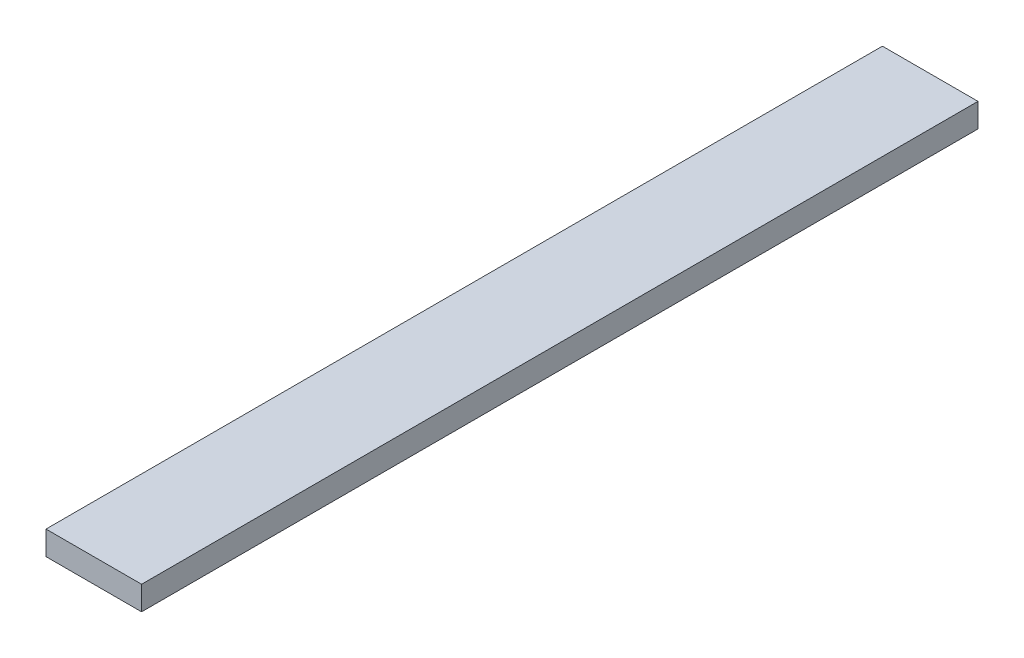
ISO-10303-21;
HEADER;
FILE_DESCRIPTION(('STEP AP214'),'2;1');
FILE_NAME('part.step','',(''),(''),'','','');
FILE_SCHEMA(('AUTOMOTIVE_DESIGN { 1 0 10303 214 1 1 1 1 }'));
ENDSEC;
DATA;
#1=APPLICATION_CONTEXT('core data for automotive mechanical design processes');
#2=APPLICATION_PROTOCOL_DEFINITION('international standard','automotive_design',2000,#1);
#3=PRODUCT_CONTEXT('',#1,'mechanical');
#4=PRODUCT('Part','Part','',(#3));
#5=PRODUCT_RELATED_PRODUCT_CATEGORY('part','',(#4));
#6=PRODUCT_DEFINITION_FORMATION('','',#4);
#7=PRODUCT_DEFINITION_CONTEXT('part definition',#1,'design');
#8=PRODUCT_DEFINITION('design','',#6,#7);
#9=PRODUCT_DEFINITION_SHAPE('','',#8);
#10=(LENGTH_UNIT() NAMED_UNIT(*) SI_UNIT(.MILLI.,.METRE.));
#11=(NAMED_UNIT(*) PLANE_ANGLE_UNIT() SI_UNIT($,.RADIAN.));
#12=(NAMED_UNIT(*) SI_UNIT($,.STERADIAN.) SOLID_ANGLE_UNIT());
#13=UNCERTAINTY_MEASURE_WITH_UNIT(LENGTH_MEASURE(1.E-05),#10,'distance_accuracy_value','');
#14=(GEOMETRIC_REPRESENTATION_CONTEXT(3) GLOBAL_UNCERTAINTY_ASSIGNED_CONTEXT((#13)) GLOBAL_UNIT_ASSIGNED_CONTEXT((#10,
#11,#12)) REPRESENTATION_CONTEXT('',''));
#15=CARTESIAN_POINT('',(0.,0.,0.));
#16=DIRECTION('',(0.,0.,1.));
#17=DIRECTION('',(1.,0.,0.));
#18=AXIS2_PLACEMENT_3D('',#15,#16,#17);
#19=CARTESIAN_POINT('',(25.4,-6.35,444.5));
#20=DIRECTION('',(-1.,0.,0.));
#21=DIRECTION('',(0.,0.,1.));
#22=AXIS2_PLACEMENT_3D('',#19,#20,#21);
#23=PLANE('',#22);
#24=DIRECTION('',(0.,1.,0.));
#25=VECTOR('',#24,1.);
#26=CARTESIAN_POINT('',(25.4,-6.35,0.));
#27=LINE('',#26,#25);
#28=CARTESIAN_POINT('',(25.4,-6.35,0.));
#29=VERTEX_POINT('',#28);
#30=CARTESIAN_POINT('',(25.4,6.35,0.));
#31=VERTEX_POINT('',#30);
#32=EDGE_CURVE('E113',#29,#31,#27,.T.);
#33=ORIENTED_EDGE('',*,*,#32,.T.);
#34=DIRECTION('',(0.,0.,-1.));
#35=VECTOR('',#34,1.);
#36=CARTESIAN_POINT('',(25.4,6.35,444.5));
#37=LINE('',#36,#35);
#38=CARTESIAN_POINT('',(25.4,6.35,444.5));
#39=VERTEX_POINT('',#38);
#40=EDGE_CURVE('E11',#39,#31,#37,.T.);
#41=ORIENTED_EDGE('',*,*,#40,.F.);
#42=DIRECTION('',(0.,1.,0.));
#43=VECTOR('',#42,1.);
#44=CARTESIAN_POINT('',(25.4,-6.35,444.5));
#45=LINE('',#44,#43);
#46=CARTESIAN_POINT('',(25.4,-6.35,444.5));
#47=VERTEX_POINT('',#46);
#48=EDGE_CURVE('E97',#47,#39,#45,.T.);
#49=ORIENTED_EDGE('',*,*,#48,.F.);
#50=DIRECTION('',(0.,0.,-1.));
#51=VECTOR('',#50,1.);
#52=CARTESIAN_POINT('',(25.4,-6.35,444.5));
#53=LINE('',#52,#51);
#54=EDGE_CURVE('E109',#47,#29,#53,.T.);
#55=ORIENTED_EDGE('',*,*,#54,.T.);
#56=EDGE_LOOP('',(#33,#41,#49,#55));
#57=FACE_BOUND('',#56,.T.);
#58=ADVANCED_FACE('F45',(#57),#23,.F.);
#59=CARTESIAN_POINT('',(-25.4,6.35,444.5));
#60=DIRECTION('',(0.,-1.,0.));
#61=DIRECTION('',(0.,0.,-1.));
#62=AXIS2_PLACEMENT_3D('',#59,#60,#61);
#63=PLANE('',#62);
#64=DIRECTION('',(-1.,0.,0.));
#65=VECTOR('',#64,1.);
#66=CARTESIAN_POINT('',(-25.4,6.35,0.));
#67=LINE('',#66,#65);
#68=CARTESIAN_POINT('',(-25.4,6.35,0.));
#69=VERTEX_POINT('',#68);
#70=EDGE_CURVE('E102',#31,#69,#67,.T.);
#71=ORIENTED_EDGE('',*,*,#70,.T.);
#72=DIRECTION('',(0.,0.,-1.));
#73=VECTOR('',#72,1.);
#74=CARTESIAN_POINT('',(-25.4,6.35,444.5));
#75=LINE('',#74,#73);
#76=CARTESIAN_POINT('',(-25.4,6.35,444.5));
#77=VERTEX_POINT('',#76);
#78=EDGE_CURVE('E54',#77,#69,#75,.T.);
#79=ORIENTED_EDGE('',*,*,#78,.F.);
#80=DIRECTION('',(-1.,0.,0.));
#81=VECTOR('',#80,1.);
#82=CARTESIAN_POINT('',(-25.4,6.35,444.5));
#83=LINE('',#82,#81);
#84=EDGE_CURVE('E92',#39,#77,#83,.T.);
#85=ORIENTED_EDGE('',*,*,#84,.F.);
#86=ORIENTED_EDGE('',*,*,#40,.T.);
#87=EDGE_LOOP('',(#71,#79,#85,#86));
#88=FACE_BOUND('',#87,.T.);
#89=ADVANCED_FACE('F101',(#88),#63,.F.);
#90=CARTESIAN_POINT('',(-25.4,-6.35,444.5));
#91=DIRECTION('',(1.,0.,0.));
#92=DIRECTION('',(0.,0.,-1.));
#93=AXIS2_PLACEMENT_3D('',#90,#91,#92);
#94=PLANE('',#93);
#95=DIRECTION('',(0.,-1.,0.));
#96=VECTOR('',#95,1.);
#97=CARTESIAN_POINT('',(-25.4,-6.35,0.));
#98=LINE('',#97,#96);
#99=CARTESIAN_POINT('',(-25.4,-6.35,0.));
#100=VERTEX_POINT('',#99);
#101=EDGE_CURVE('E79',#69,#100,#98,.T.);
#102=ORIENTED_EDGE('',*,*,#101,.T.);
#103=DIRECTION('',(0.,0.,-1.));
#104=VECTOR('',#103,1.);
#105=CARTESIAN_POINT('',(-25.4,-6.35,444.5));
#106=LINE('',#105,#104);
#107=CARTESIAN_POINT('',(-25.4,-6.35,444.5));
#108=VERTEX_POINT('',#107);
#109=EDGE_CURVE('E104',#108,#100,#106,.T.);
#110=ORIENTED_EDGE('',*,*,#109,.F.);
#111=DIRECTION('',(0.,-1.,0.));
#112=VECTOR('',#111,1.);
#113=CARTESIAN_POINT('',(-25.4,-6.35,444.5));
#114=LINE('',#113,#112);
#115=EDGE_CURVE('E95',#77,#108,#114,.T.);
#116=ORIENTED_EDGE('',*,*,#115,.F.);
#117=ORIENTED_EDGE('',*,*,#78,.T.);
#118=EDGE_LOOP('',(#102,#110,#116,#117));
#119=FACE_BOUND('',#118,.T.);
#120=ADVANCED_FACE('F105',(#119),#94,.F.);
#121=CARTESIAN_POINT('',(-25.4,-6.35,444.5));
#122=DIRECTION('',(0.,1.,0.));
#123=DIRECTION('',(0.,0.,1.));
#124=AXIS2_PLACEMENT_3D('',#121,#122,#123);
#125=PLANE('',#124);
#126=DIRECTION('',(1.,0.,0.));
#127=VECTOR('',#126,1.);
#128=CARTESIAN_POINT('',(-25.4,-6.35,0.));
#129=LINE('',#128,#127);
#130=EDGE_CURVE('E85',#100,#29,#129,.T.);
#131=ORIENTED_EDGE('',*,*,#130,.T.);
#132=ORIENTED_EDGE('',*,*,#54,.F.);
#133=DIRECTION('',(1.,0.,0.));
#134=VECTOR('',#133,1.);
#135=CARTESIAN_POINT('',(-25.4,-6.35,444.5));
#136=LINE('',#135,#134);
#137=EDGE_CURVE('E62',#108,#47,#136,.T.);
#138=ORIENTED_EDGE('',*,*,#137,.F.);
#139=ORIENTED_EDGE('',*,*,#109,.T.);
#140=EDGE_LOOP('',(#131,#132,#138,#139));
#141=FACE_BOUND('',#140,.T.);
#142=ADVANCED_FACE('F126',(#141),#125,.F.);
#143=CARTESIAN_POINT('',(0.,0.,444.5));
#144=DIRECTION('',(0.,0.,-1.));
#145=DIRECTION('',(-1.,0.,0.));
#146=AXIS2_PLACEMENT_3D('',#143,#144,#145);
#147=PLANE('',#146);
#148=ORIENTED_EDGE('',*,*,#48,.T.);
#149=ORIENTED_EDGE('',*,*,#84,.T.);
#150=ORIENTED_EDGE('',*,*,#115,.T.);
#151=ORIENTED_EDGE('',*,*,#137,.T.);
#152=EDGE_LOOP('',(#148,#149,#150,#151));
#153=FACE_BOUND('',#152,.T.);
#154=ADVANCED_FACE('F93',(#153),#147,.F.);
#155=CARTESIAN_POINT('',(0.,0.,0.));
#156=DIRECTION('',(0.,0.,-1.));
#157=DIRECTION('',(-1.,0.,0.));
#158=AXIS2_PLACEMENT_3D('',#155,#156,#157);
#159=PLANE('',#158);
#160=ORIENTED_EDGE('',*,*,#32,.F.);
#161=ORIENTED_EDGE('',*,*,#130,.F.);
#162=ORIENTED_EDGE('',*,*,#101,.F.);
#163=ORIENTED_EDGE('',*,*,#70,.F.);
#164=EDGE_LOOP('',(#160,#161,#162,#163));
#165=FACE_BOUND('',#164,.T.);
#166=ADVANCED_FACE('F129',(#165),#159,.T.);
#167=CLOSED_SHELL('',(#58,#89,#120,#142,#154,#166));
#168=MANIFOLD_SOLID_BREP('B2',#167);
#169=ADVANCED_BREP_SHAPE_REPRESENTATION('',(#18,#168),#14);
#170=SHAPE_DEFINITION_REPRESENTATION(#9,#169);
ENDSEC;
END-ISO-10303-21;
